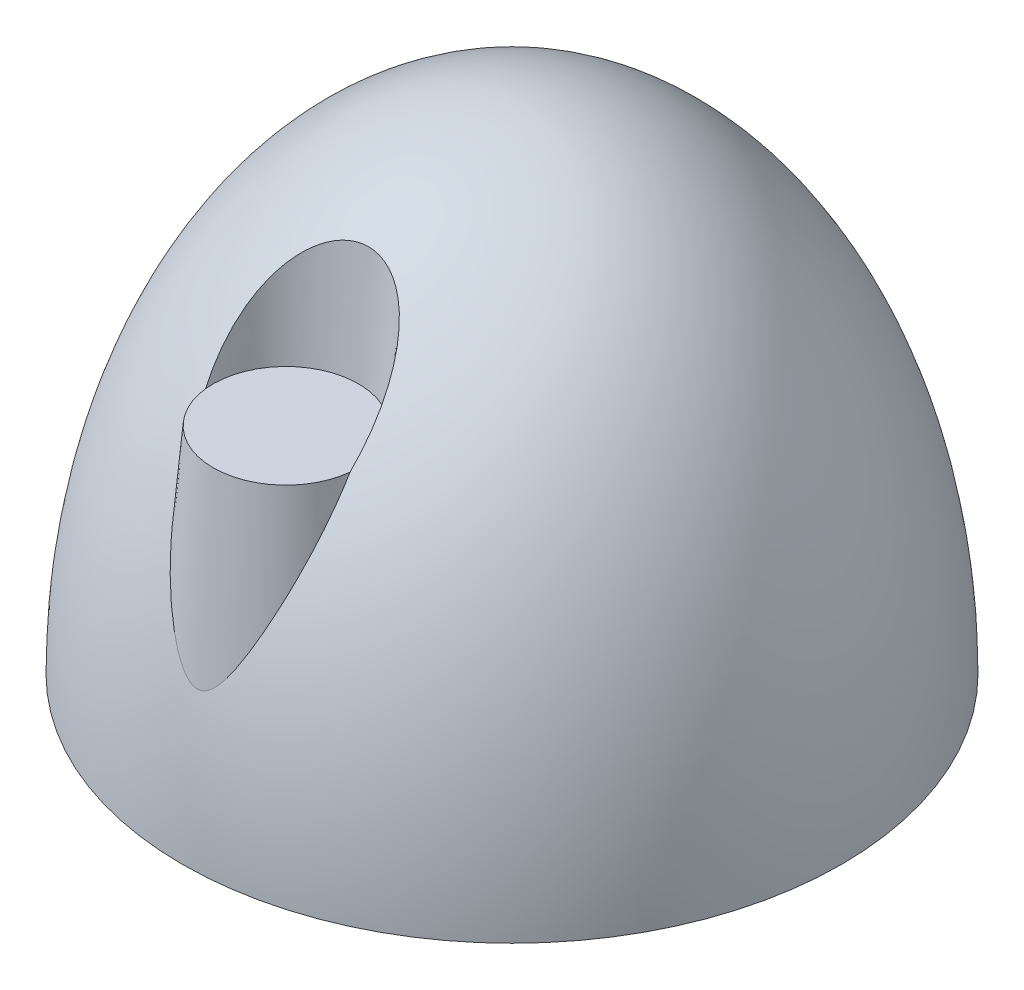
from build123d import *

# Parameters (mm, degrees)
SKETCH2_R          = 11.25
EXTRUDE1_DEPTH     = 50.8
CUT_EXTRUDE1_START = 50.8
SKETCH2_2_R        = 11.25
CUT_EXTRUDE1_DEPTH = 54.975951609
CUT_EXTRUDE1_DRAFT = -5
DRAFT1_ANGLE       = 5


with BuildPart() as part:
    # Sketch1 → Revolve1 (revolve)
    with BuildSketch(Plane.ZY):
        with BuildLine():
            Line((0, 0), (0, 76))
            add(Edge.make_bspline(
                [(51, 0), (51, 76), (0, 76)],
                knots=[4.71238898, 4.71238898, 4.71238898, 6.283185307, 6.283185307, 6.283185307], degree=2, weights=[1, 0.707106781, 1]))
            Line((51, 0), (0, 0))
        make_face()
    revolve(axis=Axis((0, 0, 0), (0, 1, 0)))

    # Sketch2 → Extrude1 (add)
    with BuildSketch(Plane(origin=(0, 0, 0), x_dir=(1, 0, 0), z_dir=(0, 1, 0))):
        with Locations((0, -35)):
            Circle(SKETCH2_R)
    extrude(amount=EXTRUDE1_DEPTH)


with BuildPart() as cut_extrude1_tool:
    # Sketch2_2 → Cut-Extrude1 (with draft: the straight prism first)
    with BuildSketch(Plane(origin=(0, 0, 0), x_dir=(1, 0, 0), z_dir=(0, 1, 0)).offset(CUT_EXTRUDE1_START)):
        with Locations((0, -35)):
            Circle(SKETCH2_2_R)
    extrude(amount=CUT_EXTRUDE1_DEPTH)
    # Cut-Extrude1: the draft: its side faces are tilted about the plane it starts from
    cut_extrude1_sides = [cut_extrude1_tool.faces().sort_by_distance(p)[0] for p in [
        (-11.25, 78.287975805, 35),
    ]]
    draft(cut_extrude1_sides, Plane(origin=(0, 0, 0), x_dir=(1, 0, 0), z_dir=(0, 1, 0)).offset(CUT_EXTRUDE1_START), CUT_EXTRUDE1_DRAFT)


with BuildPart() as part_1:
    add(part.part)

    # Cut-Extrude1: cut by cut_extrude1_tool
    add(cut_extrude1_tool.part, mode=Mode.SUBTRACT)

    # Draft1
    draft1_faces = [part_1.faces().sort_by_distance(p)[0] for p in [
        (0, 41.414191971, 46.25),
    ]]
    draft(draft1_faces, Plane(origin=(0, 50.8, 35), x_dir=(0, 0, 1), z_dir=(0, 1, 0)), DRAFT1_ANGLE)


solid = part_1.part
